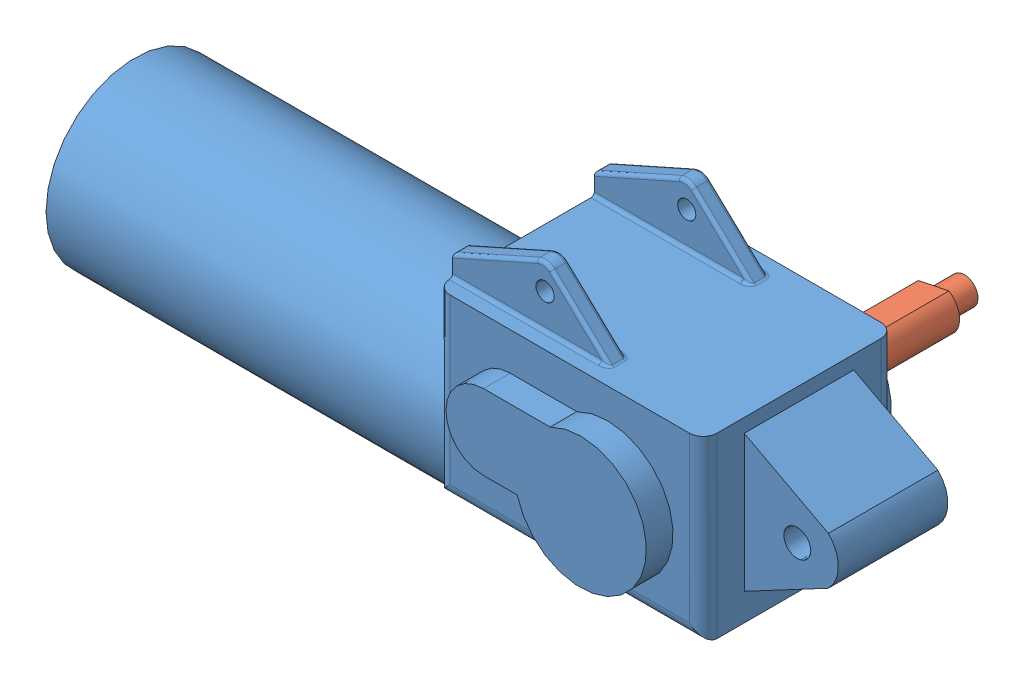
SolidWorks assembly wheelchairmotorleft.SLDASM, configuration Default (file format 3400). Lengths in mm.
Overall size (351.63 132.18 177.93).
2 component instances, 2 part files, 1 mates.
Components (placement in the parent):
- wheelchairmotorL-1: wheelchairmotorL.SLDPRT [Default] at (-200.2132 35.2252 81.7183) size (351.63 132.18 113.64)
- driveshaft-1: driveshaft.SLDPRT [Default] at (63.3118 54.2752 31.2485) x (-0.979445 -0.201711 0) z (0 0 -1) size (25 25 70.64)
Mates (geometry in assembly coordinates):
- Coincident1: coincident anti-aligned: circle of wheelchairmotorL-1; circle of driveshaft-1
